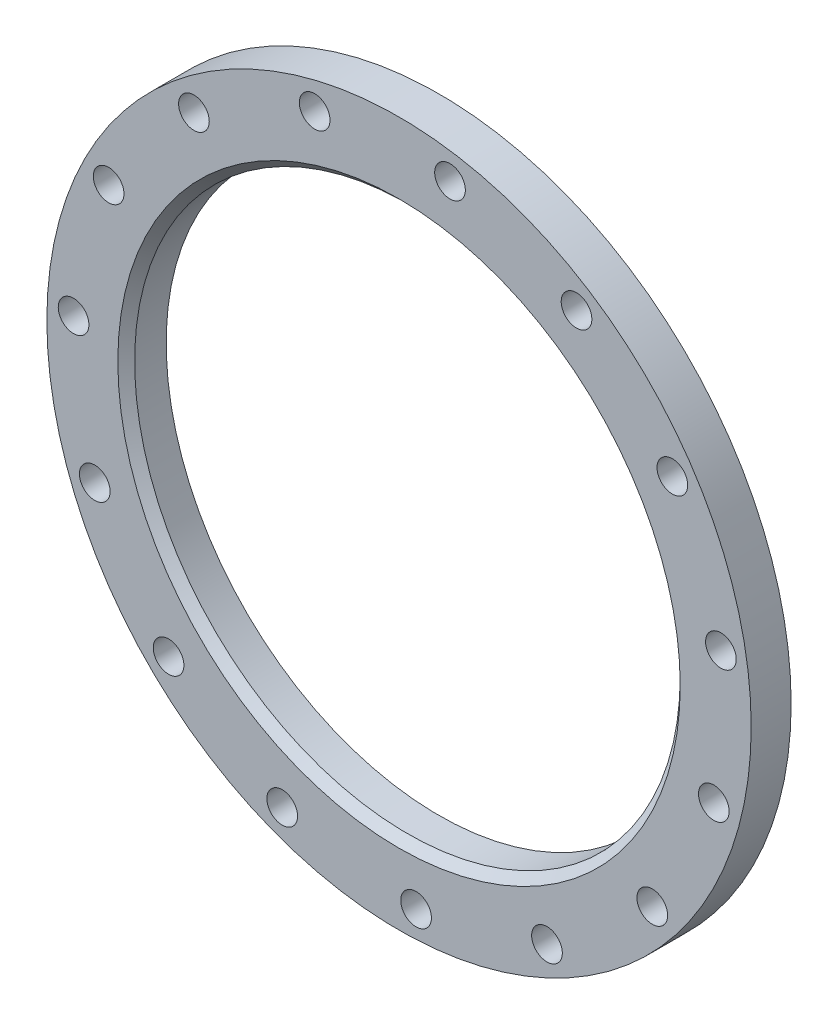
from build123d import *

# Parameters (mm, degrees)
SKETCH1_R          = 335
SKETCH1_R_2        = 259.5
EXTRUDE1_DEPTH     = 38
CHAMFER1_SIZE      = 8
SKETCH2_R          = 14.587474
CUT_EXTRUDE1_DEPTH = 476.283073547
CIRPATTERN1_COUNT  = 15


with BuildPart() as part:
    # Sketch1 → Extrude1 (new body)
    with BuildSketch(Plane.XY):
        Circle(SKETCH1_R)
        Circle(SKETCH1_R_2, mode=Mode.SUBTRACT)
    extrude(amount=EXTRUDE1_DEPTH)

    # Chamfer1
    chamfer1_edges = [part.edges().sort_by_distance(p)[0] for p in [
        (-259.5, 0, 38),
    ]]
    chamfer(chamfer1_edges, length=CHAMFER1_SIZE)

    # Sketch2 → Cut-Extrude1 (cut, through all)
    with BuildSketch(Plane.XY.offset(38)):
        with Locations((48.494684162, 306.183385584)):
            Circle(SKETCH2_R)
    cut_extrude1 = extrude(amount=-CUT_EXTRUDE1_DEPTH, mode=Mode.SUBTRACT)

    # CirPattern1: Cut-Extrude1 ×15 about axis
    cirpattern1_axis = Axis((0, 0, 0), (0, 0, 1))
    for i in range(1, CIRPATTERN1_COUNT):
        add(cut_extrude1.rotate(cirpattern1_axis, i * 360 / CIRPATTERN1_COUNT), mode=Mode.SUBTRACT)


solid = part.part
